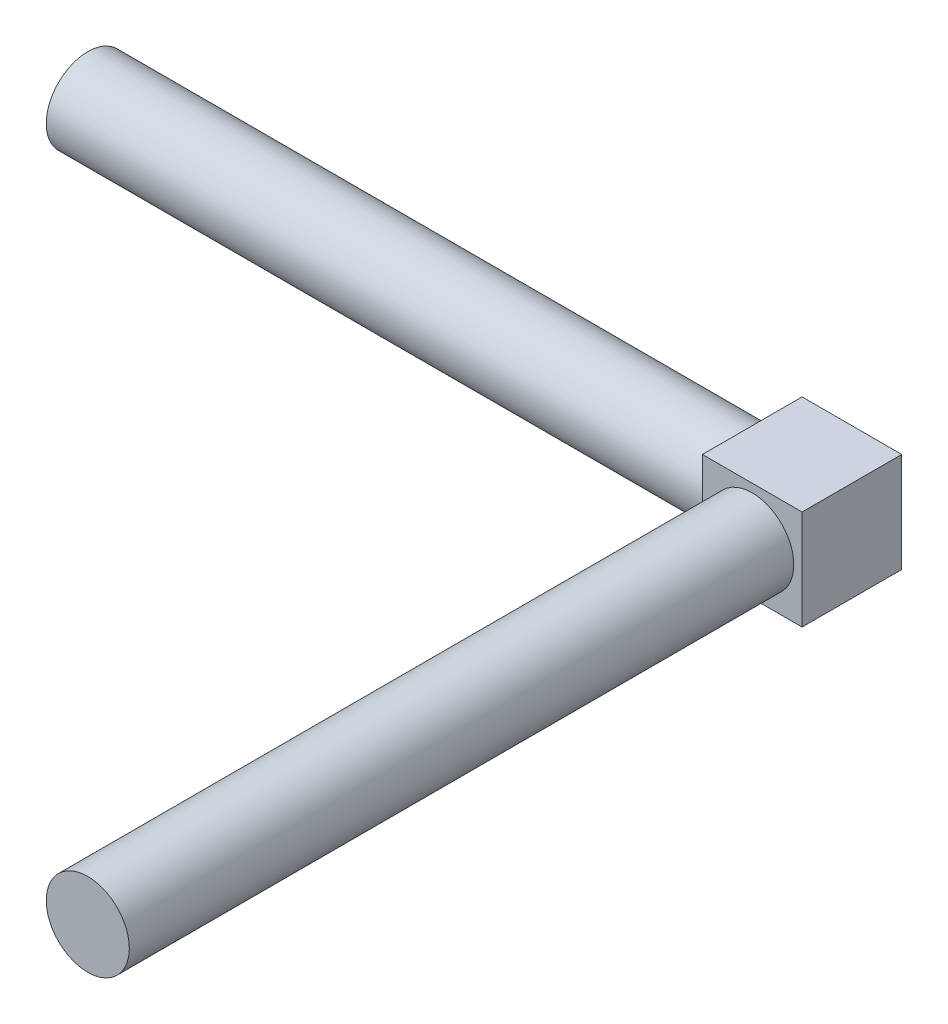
ISO-10303-21;
HEADER;
FILE_DESCRIPTION(('STEP AP214'),'2;1');
FILE_NAME('part.step','',(''),(''),'','','');
FILE_SCHEMA(('AUTOMOTIVE_DESIGN { 1 0 10303 214 1 1 1 1 }'));
ENDSEC;
DATA;
#1=APPLICATION_CONTEXT('core data for automotive mechanical design processes');
#2=APPLICATION_PROTOCOL_DEFINITION('international standard','automotive_design',2000,#1);
#3=PRODUCT_CONTEXT('',#1,'mechanical');
#4=PRODUCT('Part','Part','',(#3));
#5=PRODUCT_RELATED_PRODUCT_CATEGORY('part','',(#4));
#6=PRODUCT_DEFINITION_FORMATION('','',#4);
#7=PRODUCT_DEFINITION_CONTEXT('part definition',#1,'design');
#8=PRODUCT_DEFINITION('design','',#6,#7);
#9=PRODUCT_DEFINITION_SHAPE('','',#8);
#10=(LENGTH_UNIT() NAMED_UNIT(*) SI_UNIT(.MILLI.,.METRE.));
#11=(NAMED_UNIT(*) PLANE_ANGLE_UNIT() SI_UNIT($,.RADIAN.));
#12=(NAMED_UNIT(*) SI_UNIT($,.STERADIAN.) SOLID_ANGLE_UNIT());
#13=UNCERTAINTY_MEASURE_WITH_UNIT(LENGTH_MEASURE(1.E-05),#10,'distance_accuracy_value','');
#14=(GEOMETRIC_REPRESENTATION_CONTEXT(3) GLOBAL_UNCERTAINTY_ASSIGNED_CONTEXT((#13)) GLOBAL_UNIT_ASSIGNED_CONTEXT((#10,
#11,#12)) REPRESENTATION_CONTEXT('',''));
#15=CARTESIAN_POINT('',(0.,0.,0.));
#16=DIRECTION('',(0.,0.,1.));
#17=DIRECTION('',(1.,0.,0.));
#18=AXIS2_PLACEMENT_3D('',#15,#16,#17);
#19=CARTESIAN_POINT('',(40.,0.,0.));
#20=DIRECTION('',(-1.,0.,0.));
#21=DIRECTION('',(0.,0.,1.));
#22=AXIS2_PLACEMENT_3D('',#19,#20,#21);
#23=CYLINDRICAL_SURFACE('',#22,5.);
#24=CARTESIAN_POINT('',(40.,0.,0.));
#25=DIRECTION('',(1.,0.,0.));
#26=DIRECTION('',(0.,0.,-1.));
#27=AXIS2_PLACEMENT_3D('',#24,#25,#26);
#28=CIRCLE('',#27,5.);
#29=CARTESIAN_POINT('',(40.,0.,-5.));
#30=VERTEX_POINT('',#29);
#31=EDGE_CURVE('E24',#30,#30,#28,.F.);
#32=ORIENTED_EDGE('',*,*,#31,.T.);
#33=EDGE_LOOP('',(#32));
#34=FACE_BOUND('',#33,.T.);
#35=CARTESIAN_POINT('',(-40.,0.,0.));
#36=DIRECTION('',(-1.,0.,0.));
#37=DIRECTION('',(0.,1.,0.));
#38=AXIS2_PLACEMENT_3D('',#35,#36,#37);
#39=CIRCLE('',#38,5.);
#40=CARTESIAN_POINT('',(-40.,5.,0.));
#41=VERTEX_POINT('',#40);
#42=EDGE_CURVE('E10',#41,#41,#39,.T.);
#43=ORIENTED_EDGE('',*,*,#42,.F.);
#44=EDGE_LOOP('',(#43));
#45=FACE_BOUND('',#44,.T.);
#46=ADVANCED_FACE('F16',(#34,#45),#23,.T.);
#47=CARTESIAN_POINT('',(-40.,0.,0.));
#48=DIRECTION('',(-1.,0.,0.));
#49=DIRECTION('',(0.,-1.,0.));
#50=AXIS2_PLACEMENT_3D('',#47,#48,#49);
#51=PLANE('',#50);
#52=ORIENTED_EDGE('',*,*,#42,.T.);
#53=EDGE_LOOP('',(#52));
#54=FACE_BOUND('',#53,.T.);
#55=ADVANCED_FACE('F121',(#54),#51,.T.);
#56=CARTESIAN_POINT('',(52.,-6.,6.00000000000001));
#57=DIRECTION('',(0.,1.,0.));
#58=DIRECTION('',(-1.,0.,0.));
#59=AXIS2_PLACEMENT_3D('',#56,#57,#58);
#60=PLANE('',#59);
#61=DIRECTION('',(0.,0.,-1.));
#62=VECTOR('',#61,1.);
#63=CARTESIAN_POINT('',(40.,-6.,6.00000000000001));
#64=LINE('',#63,#62);
#65=CARTESIAN_POINT('',(40.,-6.,6.00000000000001));
#66=VERTEX_POINT('',#65);
#67=CARTESIAN_POINT('',(40.,-6.,-5.99999999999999));
#68=VERTEX_POINT('',#67);
#69=EDGE_CURVE('E62',#66,#68,#64,.T.);
#70=ORIENTED_EDGE('',*,*,#69,.T.);
#71=DIRECTION('',(-1.,0.,0.));
#72=VECTOR('',#71,1.);
#73=CARTESIAN_POINT('',(52.,-6.,-5.99999999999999));
#74=LINE('',#73,#72);
#75=CARTESIAN_POINT('',(52.,-6.,-5.99999999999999));
#76=VERTEX_POINT('',#75);
#77=EDGE_CURVE('E70',#76,#68,#74,.T.);
#78=ORIENTED_EDGE('',*,*,#77,.F.);
#79=DIRECTION('',(0.,0.,-1.));
#80=VECTOR('',#79,1.);
#81=CARTESIAN_POINT('',(52.,-6.,6.00000000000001));
#82=LINE('',#81,#80);
#83=CARTESIAN_POINT('',(52.,-6.,6.00000000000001));
#84=VERTEX_POINT('',#83);
#85=EDGE_CURVE('E93',#84,#76,#82,.T.);
#86=ORIENTED_EDGE('',*,*,#85,.F.);
#87=DIRECTION('',(-1.,0.,0.));
#88=VECTOR('',#87,1.);
#89=CARTESIAN_POINT('',(52.,-6.,6.00000000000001));
#90=LINE('',#89,#88);
#91=EDGE_CURVE('E79',#84,#66,#90,.T.);
#92=ORIENTED_EDGE('',*,*,#91,.T.);
#93=EDGE_LOOP('',(#70,#78,#86,#92));
#94=FACE_BOUND('',#93,.T.);
#95=ADVANCED_FACE('F78',(#94),#60,.F.);
#96=CARTESIAN_POINT('',(52.,-6.,-5.99999999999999));
#97=DIRECTION('',(0.,0.,1.));
#98=DIRECTION('',(1.,0.,0.));
#99=AXIS2_PLACEMENT_3D('',#96,#97,#98);
#100=PLANE('',#99);
#101=DIRECTION('',(0.,1.,0.));
#102=VECTOR('',#101,1.);
#103=CARTESIAN_POINT('',(40.,-6.,-5.99999999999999));
#104=LINE('',#103,#102);
#105=CARTESIAN_POINT('',(40.,6.,-5.99999999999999));
#106=VERTEX_POINT('',#105);
#107=EDGE_CURVE('E57',#68,#106,#104,.T.);
#108=ORIENTED_EDGE('',*,*,#107,.T.);
#109=DIRECTION('',(-1.,0.,0.));
#110=VECTOR('',#109,1.);
#111=CARTESIAN_POINT('',(52.,6.,-5.99999999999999));
#112=LINE('',#111,#110);
#113=CARTESIAN_POINT('',(52.,6.,-5.99999999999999));
#114=VERTEX_POINT('',#113);
#115=EDGE_CURVE('E75',#114,#106,#112,.T.);
#116=ORIENTED_EDGE('',*,*,#115,.F.);
#117=DIRECTION('',(0.,1.,0.));
#118=VECTOR('',#117,1.);
#119=CARTESIAN_POINT('',(52.,-6.,-5.99999999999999));
#120=LINE('',#119,#118);
#121=EDGE_CURVE('E72',#76,#114,#120,.T.);
#122=ORIENTED_EDGE('',*,*,#121,.F.);
#123=ORIENTED_EDGE('',*,*,#77,.T.);
#124=EDGE_LOOP('',(#108,#116,#122,#123));
#125=FACE_BOUND('',#124,.T.);
#126=ADVANCED_FACE('F71',(#125),#100,.F.);
#127=CARTESIAN_POINT('',(52.,6.,-5.99999999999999));
#128=DIRECTION('',(0.,-1.,0.));
#129=DIRECTION('',(1.,0.,0.));
#130=AXIS2_PLACEMENT_3D('',#127,#128,#129);
#131=PLANE('',#130);
#132=DIRECTION('',(0.,0.,1.));
#133=VECTOR('',#132,1.);
#134=CARTESIAN_POINT('',(40.,6.,-5.99999999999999));
#135=LINE('',#134,#133);
#136=CARTESIAN_POINT('',(40.,6.,6.00000000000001));
#137=VERTEX_POINT('',#136);
#138=EDGE_CURVE('E63',#106,#137,#135,.T.);
#139=ORIENTED_EDGE('',*,*,#138,.T.);
#140=DIRECTION('',(-1.,0.,0.));
#141=VECTOR('',#140,1.);
#142=CARTESIAN_POINT('',(52.,6.,6.00000000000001));
#143=LINE('',#142,#141);
#144=CARTESIAN_POINT('',(52.,6.,6.00000000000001));
#145=VERTEX_POINT('',#144);
#146=EDGE_CURVE('E98',#145,#137,#143,.T.);
#147=ORIENTED_EDGE('',*,*,#146,.F.);
#148=DIRECTION('',(0.,0.,1.));
#149=VECTOR('',#148,1.);
#150=CARTESIAN_POINT('',(52.,6.,-5.99999999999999));
#151=LINE('',#150,#149);
#152=EDGE_CURVE('E36',#114,#145,#151,.T.);
#153=ORIENTED_EDGE('',*,*,#152,.F.);
#154=ORIENTED_EDGE('',*,*,#115,.T.);
#155=EDGE_LOOP('',(#139,#147,#153,#154));
#156=FACE_BOUND('',#155,.T.);
#157=ADVANCED_FACE('F133',(#156),#131,.F.);
#158=CARTESIAN_POINT('',(52.,6.,6.00000000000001));
#159=DIRECTION('',(0.,0.,-1.));
#160=DIRECTION('',(-1.,0.,0.));
#161=AXIS2_PLACEMENT_3D('',#158,#159,#160);
#162=PLANE('',#161);
#163=CARTESIAN_POINT('',(46.,0.,6.00000000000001));
#164=DIRECTION('',(0.,0.,-1.));
#165=DIRECTION('',(1.,0.,0.));
#166=AXIS2_PLACEMENT_3D('',#163,#164,#165);
#167=CIRCLE('',#166,5.);
#168=CARTESIAN_POINT('',(51.,0.,6.00000000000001));
#169=VERTEX_POINT('',#168);
#170=EDGE_CURVE('E86',#169,#169,#167,.T.);
#171=ORIENTED_EDGE('',*,*,#170,.T.);
#172=EDGE_LOOP('',(#171));
#173=FACE_BOUND('',#172,.T.);
#174=DIRECTION('',(0.,-1.,0.));
#175=VECTOR('',#174,1.);
#176=CARTESIAN_POINT('',(40.,6.,6.00000000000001));
#177=LINE('',#176,#175);
#178=EDGE_CURVE('E90',#137,#66,#177,.T.);
#179=ORIENTED_EDGE('',*,*,#178,.T.);
#180=ORIENTED_EDGE('',*,*,#91,.F.);
#181=DIRECTION('',(0.,-1.,0.));
#182=VECTOR('',#181,1.);
#183=CARTESIAN_POINT('',(52.,6.,6.00000000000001));
#184=LINE('',#183,#182);
#185=EDGE_CURVE('E31',#145,#84,#184,.T.);
#186=ORIENTED_EDGE('',*,*,#185,.F.);
#187=ORIENTED_EDGE('',*,*,#146,.T.);
#188=EDGE_LOOP('',(#179,#180,#186,#187));
#189=FACE_BOUND('',#188,.T.);
#190=ADVANCED_FACE('F118',(#173,#189),#162,.F.);
#191=CARTESIAN_POINT('',(52.,-6.,-5.99999999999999));
#192=DIRECTION('',(1.,0.,0.));
#193=DIRECTION('',(0.,0.,-1.));
#194=AXIS2_PLACEMENT_3D('',#191,#192,#193);
#195=PLANE('',#194);
#196=ORIENTED_EDGE('',*,*,#85,.T.);
#197=ORIENTED_EDGE('',*,*,#121,.T.);
#198=ORIENTED_EDGE('',*,*,#152,.T.);
#199=ORIENTED_EDGE('',*,*,#185,.T.);
#200=EDGE_LOOP('',(#196,#197,#198,#199));
#201=FACE_BOUND('',#200,.T.);
#202=ADVANCED_FACE('F108',(#201),#195,.T.);
#203=CARTESIAN_POINT('',(40.,-6.,-5.99999999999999));
#204=DIRECTION('',(1.,0.,0.));
#205=DIRECTION('',(0.,0.,-1.));
#206=AXIS2_PLACEMENT_3D('',#203,#204,#205);
#207=PLANE('',#206);
#208=ORIENTED_EDGE('',*,*,#31,.F.);
#209=EDGE_LOOP('',(#208));
#210=FACE_BOUND('',#209,.T.);
#211=ORIENTED_EDGE('',*,*,#69,.F.);
#212=ORIENTED_EDGE('',*,*,#178,.F.);
#213=ORIENTED_EDGE('',*,*,#138,.F.);
#214=ORIENTED_EDGE('',*,*,#107,.F.);
#215=EDGE_LOOP('',(#211,#212,#213,#214));
#216=FACE_BOUND('',#215,.T.);
#217=ADVANCED_FACE('F59',(#210,#216),#207,.F.);
#218=CARTESIAN_POINT('',(46.,0.,86.));
#219=DIRECTION('',(0.,0.,-1.));
#220=DIRECTION('',(-1.,0.,0.));
#221=AXIS2_PLACEMENT_3D('',#218,#219,#220);
#222=CYLINDRICAL_SURFACE('',#221,5.);
#223=CARTESIAN_POINT('',(46.,0.,86.));
#224=DIRECTION('',(0.,0.,-1.));
#225=DIRECTION('',(1.,0.,0.));
#226=AXIS2_PLACEMENT_3D('',#223,#224,#225);
#227=CIRCLE('',#226,5.);
#228=CARTESIAN_POINT('',(51.,0.,86.));
#229=VERTEX_POINT('',#228);
#230=EDGE_CURVE('E81',#229,#229,#227,.T.);
#231=ORIENTED_EDGE('',*,*,#230,.T.);
#232=EDGE_LOOP('',(#231));
#233=FACE_BOUND('',#232,.T.);
#234=ORIENTED_EDGE('',*,*,#170,.F.);
#235=EDGE_LOOP('',(#234));
#236=FACE_BOUND('',#235,.T.);
#237=ADVANCED_FACE('F107',(#233,#236),#222,.T.);
#238=CARTESIAN_POINT('',(46.,0.,86.));
#239=DIRECTION('',(0.,0.,-1.));
#240=DIRECTION('',(-1.,0.,0.));
#241=AXIS2_PLACEMENT_3D('',#238,#239,#240);
#242=PLANE('',#241);
#243=ORIENTED_EDGE('',*,*,#230,.F.);
#244=EDGE_LOOP('',(#243));
#245=FACE_BOUND('',#244,.T.);
#246=ADVANCED_FACE('F115',(#245),#242,.F.);
#247=CLOSED_SHELL('',(#46,#55,#95,#126,#157,#190,#202,#217,#237,#246));
#248=MANIFOLD_SOLID_BREP('B1',#247);
#249=ADVANCED_BREP_SHAPE_REPRESENTATION('',(#18,#248),#14);
#250=SHAPE_DEFINITION_REPRESENTATION(#9,#249);
ENDSEC;
END-ISO-10303-21;
